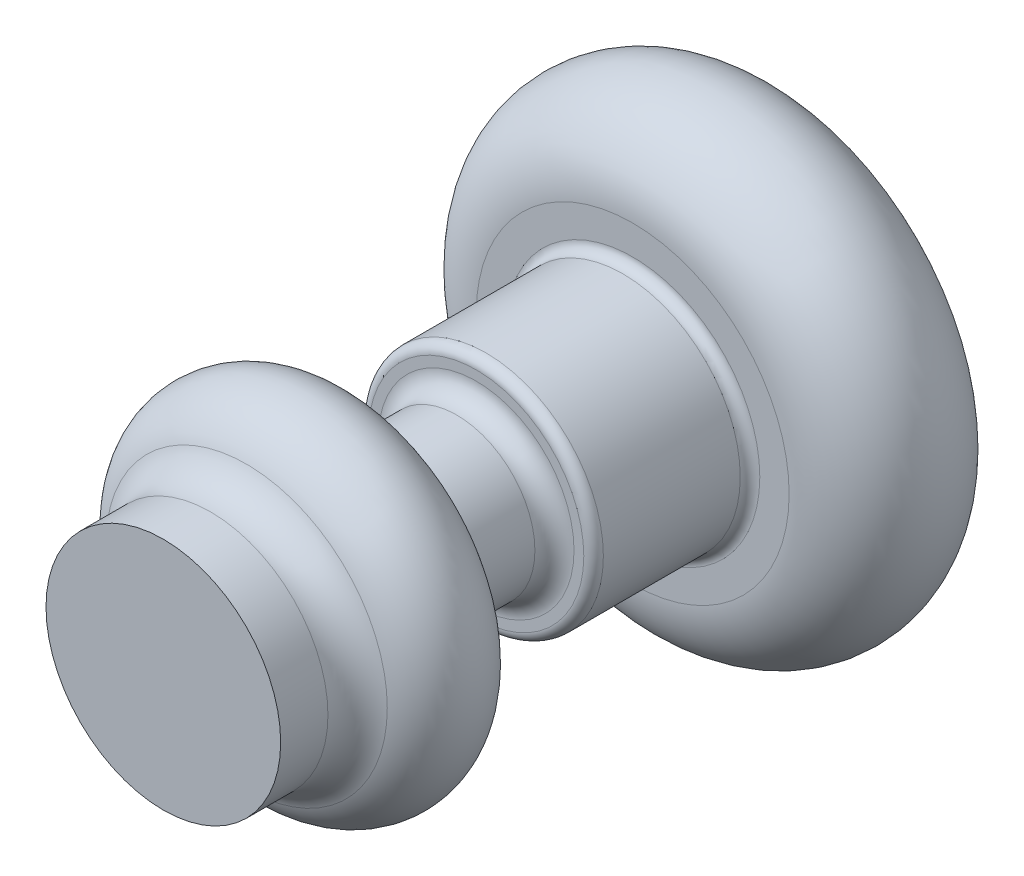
ISO-10303-21;
HEADER;
FILE_DESCRIPTION(('STEP AP214'),'2;1');
FILE_NAME('part.step','',(''),(''),'','','');
FILE_SCHEMA(('AUTOMOTIVE_DESIGN { 1 0 10303 214 1 1 1 1 }'));
ENDSEC;
DATA;
#1=APPLICATION_CONTEXT('core data for automotive mechanical design processes');
#2=APPLICATION_PROTOCOL_DEFINITION('international standard','automotive_design',2000,#1);
#3=PRODUCT_CONTEXT('',#1,'mechanical');
#4=PRODUCT('Part','Part','',(#3));
#5=PRODUCT_RELATED_PRODUCT_CATEGORY('part','',(#4));
#6=PRODUCT_DEFINITION_FORMATION('','',#4);
#7=PRODUCT_DEFINITION_CONTEXT('part definition',#1,'design');
#8=PRODUCT_DEFINITION('design','',#6,#7);
#9=PRODUCT_DEFINITION_SHAPE('','',#8);
#10=(LENGTH_UNIT() NAMED_UNIT(*) SI_UNIT(.MILLI.,.METRE.));
#11=(NAMED_UNIT(*) PLANE_ANGLE_UNIT() SI_UNIT($,.RADIAN.));
#12=(NAMED_UNIT(*) SI_UNIT($,.STERADIAN.) SOLID_ANGLE_UNIT());
#13=UNCERTAINTY_MEASURE_WITH_UNIT(LENGTH_MEASURE(1.E-05),#10,'distance_accuracy_value','');
#14=(GEOMETRIC_REPRESENTATION_CONTEXT(3) GLOBAL_UNCERTAINTY_ASSIGNED_CONTEXT((#13)) GLOBAL_UNIT_ASSIGNED_CONTEXT((#10,
#11,#12)) REPRESENTATION_CONTEXT('',''));
#15=CARTESIAN_POINT('',(0.,0.,0.));
#16=DIRECTION('',(0.,0.,1.));
#17=DIRECTION('',(1.,0.,0.));
#18=AXIS2_PLACEMENT_3D('',#15,#16,#17);
#19=CARTESIAN_POINT('',(0.,0.,81.6));
#20=DIRECTION('',(0.,0.,1.));
#21=DIRECTION('',(1.,0.,0.));
#22=AXIS2_PLACEMENT_3D('',#19,#20,#21);
#23=PLANE('',#22);
#24=CARTESIAN_POINT('',(0.,0.,81.6));
#25=DIRECTION('',(0.,0.,1.));
#26=DIRECTION('',(1.,0.,0.));
#27=AXIS2_PLACEMENT_3D('',#24,#25,#26);
#28=CIRCLE('',#27,30.6);
#29=CARTESIAN_POINT('',(30.6,0.,81.6));
#30=VERTEX_POINT('',#29);
#31=EDGE_CURVE('E10',#30,#30,#28,.T.);
#32=ORIENTED_EDGE('',*,*,#31,.T.);
#33=EDGE_LOOP('',(#32));
#34=FACE_BOUND('',#33,.T.);
#35=ADVANCED_FACE('F33',(#34),#23,.T.);
#36=CARTESIAN_POINT('',(0.,0.,81.6));
#37=DIRECTION('',(0.,0.,1.));
#38=DIRECTION('',(1.,0.,0.));
#39=AXIS2_PLACEMENT_3D('',#36,#37,#38);
#40=CYLINDRICAL_SURFACE('',#39,30.6);
#41=CARTESIAN_POINT('',(0.,0.,69.2711360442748));
#42=DIRECTION('',(0.,0.,1.));
#43=DIRECTION('',(1.,0.,0.));
#44=AXIS2_PLACEMENT_3D('',#41,#42,#43);
#45=CIRCLE('',#44,30.6);
#46=CARTESIAN_POINT('',(30.6,0.,69.2711360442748));
#47=VERTEX_POINT('',#46);
#48=EDGE_CURVE('E39',#47,#47,#45,.T.);
#49=ORIENTED_EDGE('',*,*,#48,.T.);
#50=EDGE_LOOP('',(#49));
#51=FACE_BOUND('',#50,.T.);
#52=ORIENTED_EDGE('',*,*,#31,.F.);
#53=EDGE_LOOP('',(#52));
#54=FACE_BOUND('',#53,.T.);
#55=ADVANCED_FACE('F92',(#51,#54),#40,.T.);
#56=CARTESIAN_POINT('',(0.,0.,69.2711360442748));
#57=DIRECTION('',(0.,0.,1.));
#58=DIRECTION('',(1.,0.,0.));
#59=AXIS2_PLACEMENT_3D('',#56,#57,#58);
#60=TOROIDAL_SURFACE('',#59,40.8,10.2);
#61=ORIENTED_EDGE('',*,*,#48,.F.);
#62=EDGE_LOOP('',(#61));
#63=FACE_BOUND('',#62,.T.);
#64=CARTESIAN_POINT('',(0.,0.,59.9226816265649));
#65=DIRECTION('',(0.,0.,1.));
#66=DIRECTION('',(1.,0.,0.));
#67=AXIS2_PLACEMENT_3D('',#64,#65,#66);
#68=CIRCLE('',#67,36.72);
#69=CARTESIAN_POINT('',(36.72,0.,59.9226816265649));
#70=VERTEX_POINT('',#69);
#71=EDGE_CURVE('E43',#70,#70,#68,.T.);
#72=ORIENTED_EDGE('',*,*,#71,.T.);
#73=EDGE_LOOP('',(#72));
#74=FACE_BOUND('',#73,.T.);
#75=ADVANCED_FACE('F96',(#63,#74),#60,.F.);
#76=CARTESIAN_POINT('',(0.,0.,45.9));
#77=DIRECTION('',(0.,0.,1.));
#78=DIRECTION('',(1.,0.,0.));
#79=AXIS2_PLACEMENT_3D('',#76,#77,#78);
#80=TOROIDAL_SURFACE('',#79,30.6,15.3);
#81=CARTESIAN_POINT('',(0.,0.,30.6));
#82=DIRECTION('',(0.,0.,1.));
#83=DIRECTION('',(1.,0.,0.));
#84=AXIS2_PLACEMENT_3D('',#81,#82,#83);
#85=CIRCLE('',#84,30.6);
#86=CARTESIAN_POINT('',(30.6,0.,30.6));
#87=VERTEX_POINT('',#86);
#88=EDGE_CURVE('E47',#87,#87,#85,.T.);
#89=ORIENTED_EDGE('',*,*,#88,.T.);
#90=EDGE_LOOP('',(#89));
#91=FACE_BOUND('',#90,.T.);
#92=ORIENTED_EDGE('',*,*,#71,.F.);
#93=EDGE_LOOP('',(#92));
#94=FACE_BOUND('',#93,.T.);
#95=ADVANCED_FACE('F100',(#91,#94),#80,.T.);
#96=CARTESIAN_POINT('',(0.,0.,20.4));
#97=DIRECTION('',(0.,0.,1.));
#98=DIRECTION('',(1.,0.,0.));
#99=AXIS2_PLACEMENT_3D('',#96,#97,#98);
#100=TOROIDAL_SURFACE('',#99,30.6,10.2);
#101=ORIENTED_EDGE('',*,*,#88,.F.);
#102=EDGE_LOOP('',(#101));
#103=FACE_BOUND('',#102,.T.);
#104=CARTESIAN_POINT('',(0.,0.,20.4));
#105=DIRECTION('',(0.,0.,1.));
#106=DIRECTION('',(1.,0.,0.));
#107=AXIS2_PLACEMENT_3D('',#104,#105,#106);
#108=CIRCLE('',#107,20.4);
#109=CARTESIAN_POINT('',(20.4,0.,20.4));
#110=VERTEX_POINT('',#109);
#111=EDGE_CURVE('E52',#110,#110,#108,.T.);
#112=ORIENTED_EDGE('',*,*,#111,.T.);
#113=EDGE_LOOP('',(#112));
#114=FACE_BOUND('',#113,.T.);
#115=ADVANCED_FACE('F107',(#103,#114),#100,.F.);
#116=CARTESIAN_POINT('',(0.,0.,81.6));
#117=DIRECTION('',(0.,0.,1.));
#118=DIRECTION('',(1.,0.,0.));
#119=AXIS2_PLACEMENT_3D('',#116,#117,#118);
#120=CYLINDRICAL_SURFACE('',#119,20.4);
#121=CARTESIAN_POINT('',(0.,0.,5.09999999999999));
#122=DIRECTION('',(0.,0.,1.));
#123=DIRECTION('',(1.,0.,0.));
#124=AXIS2_PLACEMENT_3D('',#121,#122,#123);
#125=CIRCLE('',#124,20.4);
#126=CARTESIAN_POINT('',(20.4,0.,5.09999999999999));
#127=VERTEX_POINT('',#126);
#128=EDGE_CURVE('E55',#127,#127,#125,.T.);
#129=ORIENTED_EDGE('',*,*,#128,.T.);
#130=EDGE_LOOP('',(#129));
#131=FACE_BOUND('',#130,.T.);
#132=ORIENTED_EDGE('',*,*,#111,.F.);
#133=EDGE_LOOP('',(#132));
#134=FACE_BOUND('',#133,.T.);
#135=ADVANCED_FACE('F111',(#131,#134),#120,.T.);
#136=CARTESIAN_POINT('',(0.,0.,5.09999999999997));
#137=DIRECTION('',(0.,0.,1.));
#138=DIRECTION('',(1.,0.,0.));
#139=AXIS2_PLACEMENT_3D('',#136,#137,#138);
#140=TOROIDAL_SURFACE('',#139,25.5,5.1);
#141=ORIENTED_EDGE('',*,*,#128,.F.);
#142=EDGE_LOOP('',(#141));
#143=FACE_BOUND('',#142,.T.);
#144=CARTESIAN_POINT('',(0.,0.,0.));
#145=DIRECTION('',(0.,0.,1.));
#146=DIRECTION('',(1.,0.,0.));
#147=AXIS2_PLACEMENT_3D('',#144,#145,#146);
#148=CIRCLE('',#147,25.5);
#149=CARTESIAN_POINT('',(25.5,0.,0.));
#150=VERTEX_POINT('',#149);
#151=EDGE_CURVE('E58',#150,#150,#148,.T.);
#152=ORIENTED_EDGE('',*,*,#151,.T.);
#153=EDGE_LOOP('',(#152));
#154=FACE_BOUND('',#153,.T.);
#155=ADVANCED_FACE('F115',(#143,#154),#140,.F.);
#156=CARTESIAN_POINT('',(0.,0.,0.));
#157=DIRECTION('',(0.,0.,1.));
#158=DIRECTION('',(1.,0.,0.));
#159=AXIS2_PLACEMENT_3D('',#156,#157,#158);
#160=PLANE('',#159);
#161=CARTESIAN_POINT('',(0.,0.,0.));
#162=DIRECTION('',(0.,0.,1.));
#163=DIRECTION('',(1.,0.,0.));
#164=AXIS2_PLACEMENT_3D('',#161,#162,#163);
#165=CIRCLE('',#164,28.05);
#166=CARTESIAN_POINT('',(28.05,0.,0.));
#167=VERTEX_POINT('',#166);
#168=EDGE_CURVE('E61',#167,#167,#165,.T.);
#169=ORIENTED_EDGE('',*,*,#168,.T.);
#170=EDGE_LOOP('',(#169));
#171=FACE_BOUND('',#170,.T.);
#172=ORIENTED_EDGE('',*,*,#151,.F.);
#173=EDGE_LOOP('',(#172));
#174=FACE_BOUND('',#173,.T.);
#175=ADVANCED_FACE('F119',(#171,#174),#160,.T.);
#176=CARTESIAN_POINT('',(0.,0.,-2.55000000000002));
#177=DIRECTION('',(0.,0.,1.));
#178=DIRECTION('',(1.,0.,0.));
#179=AXIS2_PLACEMENT_3D('',#176,#177,#178);
#180=TOROIDAL_SURFACE('',#179,28.05,2.55);
#181=CARTESIAN_POINT('',(0.,0.,-2.55000000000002));
#182=DIRECTION('',(0.,0.,1.));
#183=DIRECTION('',(1.,0.,0.));
#184=AXIS2_PLACEMENT_3D('',#181,#182,#183);
#185=CIRCLE('',#184,30.6);
#186=CARTESIAN_POINT('',(30.6,0.,-2.55000000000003));
#187=VERTEX_POINT('',#186);
#188=EDGE_CURVE('E64',#187,#187,#185,.T.);
#189=ORIENTED_EDGE('',*,*,#188,.T.);
#190=EDGE_LOOP('',(#189));
#191=FACE_BOUND('',#190,.T.);
#192=ORIENTED_EDGE('',*,*,#168,.F.);
#193=EDGE_LOOP('',(#192));
#194=FACE_BOUND('',#193,.T.);
#195=ADVANCED_FACE('F123',(#191,#194),#180,.T.);
#196=CARTESIAN_POINT('',(0.,0.,81.6));
#197=DIRECTION('',(0.,0.,1.));
#198=DIRECTION('',(1.,0.,0.));
#199=AXIS2_PLACEMENT_3D('',#196,#197,#198);
#200=CYLINDRICAL_SURFACE('',#199,30.6);
#201=CARTESIAN_POINT('',(0.,0.,-38.25));
#202=DIRECTION('',(0.,0.,1.));
#203=DIRECTION('',(1.,0.,0.));
#204=AXIS2_PLACEMENT_3D('',#201,#202,#203);
#205=CIRCLE('',#204,30.6);
#206=CARTESIAN_POINT('',(30.6,0.,-38.25));
#207=VERTEX_POINT('',#206);
#208=EDGE_CURVE('E67',#207,#207,#205,.T.);
#209=ORIENTED_EDGE('',*,*,#208,.T.);
#210=EDGE_LOOP('',(#209));
#211=FACE_BOUND('',#210,.T.);
#212=ORIENTED_EDGE('',*,*,#188,.F.);
#213=EDGE_LOOP('',(#212));
#214=FACE_BOUND('',#213,.T.);
#215=ADVANCED_FACE('F127',(#211,#214),#200,.T.);
#216=CARTESIAN_POINT('',(0.,0.,-38.25));
#217=DIRECTION('',(0.,0.,1.));
#218=DIRECTION('',(1.,0.,0.));
#219=AXIS2_PLACEMENT_3D('',#216,#217,#218);
#220=TOROIDAL_SURFACE('',#219,33.15,2.55);
#221=ORIENTED_EDGE('',*,*,#208,.F.);
#222=EDGE_LOOP('',(#221));
#223=FACE_BOUND('',#222,.T.);
#224=CARTESIAN_POINT('',(0.,0.,-40.8));
#225=DIRECTION('',(0.,0.,1.));
#226=DIRECTION('',(1.,0.,0.));
#227=AXIS2_PLACEMENT_3D('',#224,#225,#226);
#228=CIRCLE('',#227,33.15);
#229=CARTESIAN_POINT('',(33.15,0.,-40.8));
#230=VERTEX_POINT('',#229);
#231=EDGE_CURVE('E70',#230,#230,#228,.T.);
#232=ORIENTED_EDGE('',*,*,#231,.T.);
#233=EDGE_LOOP('',(#232));
#234=FACE_BOUND('',#233,.T.);
#235=ADVANCED_FACE('F131',(#223,#234),#220,.F.);
#236=CARTESIAN_POINT('',(0.,0.,-40.8));
#237=DIRECTION('',(0.,0.,1.));
#238=DIRECTION('',(1.,0.,0.));
#239=AXIS2_PLACEMENT_3D('',#236,#237,#238);
#240=PLANE('',#239);
#241=CARTESIAN_POINT('',(0.,0.,-40.8));
#242=DIRECTION('',(0.,0.,1.));
#243=DIRECTION('',(1.,0.,0.));
#244=AXIS2_PLACEMENT_3D('',#241,#242,#243);
#245=CIRCLE('',#244,40.8);
#246=CARTESIAN_POINT('',(40.8,0.,-40.8));
#247=VERTEX_POINT('',#246);
#248=EDGE_CURVE('E73',#247,#247,#245,.T.);
#249=ORIENTED_EDGE('',*,*,#248,.T.);
#250=EDGE_LOOP('',(#249));
#251=FACE_BOUND('',#250,.T.);
#252=ORIENTED_EDGE('',*,*,#231,.F.);
#253=EDGE_LOOP('',(#252));
#254=FACE_BOUND('',#253,.T.);
#255=ADVANCED_FACE('F89',(#251,#254),#240,.T.);
#256=CARTESIAN_POINT('',(0.,0.,-61.2));
#257=DIRECTION('',(0.,0.,1.));
#258=DIRECTION('',(1.,0.,0.));
#259=AXIS2_PLACEMENT_3D('',#256,#257,#258);
#260=TOROIDAL_SURFACE('',#259,40.8,20.4);
#261=CARTESIAN_POINT('',(0.,0.,-81.6));
#262=DIRECTION('',(0.,0.,1.));
#263=DIRECTION('',(1.,0.,0.));
#264=AXIS2_PLACEMENT_3D('',#261,#262,#263);
#265=CIRCLE('',#264,40.8);
#266=CARTESIAN_POINT('',(40.8,0.,-81.6));
#267=VERTEX_POINT('',#266);
#268=EDGE_CURVE('E76',#267,#267,#265,.T.);
#269=ORIENTED_EDGE('',*,*,#268,.T.);
#270=EDGE_LOOP('',(#269));
#271=FACE_BOUND('',#270,.T.);
#272=ORIENTED_EDGE('',*,*,#248,.F.);
#273=EDGE_LOOP('',(#272));
#274=FACE_BOUND('',#273,.T.);
#275=ADVANCED_FACE('F80',(#271,#274),#260,.T.);
#276=CARTESIAN_POINT('',(0.,0.,-81.6));
#277=DIRECTION('',(0.,0.,-1.));
#278=DIRECTION('',(-1.,0.,0.));
#279=AXIS2_PLACEMENT_3D('',#276,#277,#278);
#280=PLANE('',#279);
#281=ORIENTED_EDGE('',*,*,#268,.F.);
#282=EDGE_LOOP('',(#281));
#283=FACE_BOUND('',#282,.T.);
#284=ADVANCED_FACE('F83',(#283),#280,.T.);
#285=CLOSED_SHELL('',(#35,#55,#75,#95,#115,#135,#155,#175,#195,#215,#235,#255,#275,#284));
#286=MANIFOLD_SOLID_BREP('B2',#285);
#287=ADVANCED_BREP_SHAPE_REPRESENTATION('',(#18,#286),#14);
#288=SHAPE_DEFINITION_REPRESENTATION(#9,#287);
ENDSEC;
END-ISO-10303-21;
